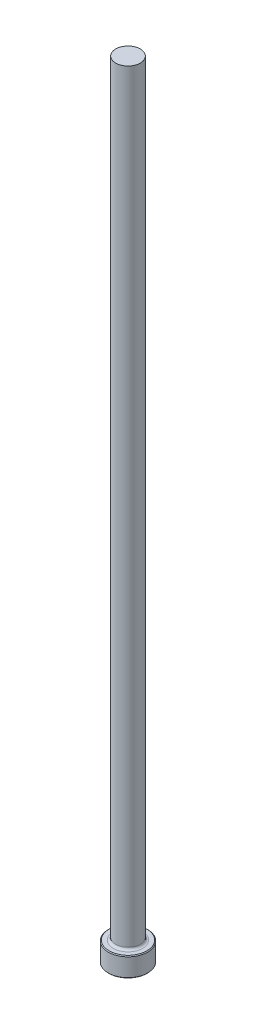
ISO-10303-21;
HEADER;
FILE_DESCRIPTION(('STEP AP214'),'2;1');
FILE_NAME('part.step','',(''),(''),'','','');
FILE_SCHEMA(('AUTOMOTIVE_DESIGN { 1 0 10303 214 1 1 1 1 }'));
ENDSEC;
DATA;
#1=APPLICATION_CONTEXT('core data for automotive mechanical design processes');
#2=APPLICATION_PROTOCOL_DEFINITION('international standard','automotive_design',2000,#1);
#3=PRODUCT_CONTEXT('',#1,'mechanical');
#4=PRODUCT('Part','Part','',(#3));
#5=PRODUCT_RELATED_PRODUCT_CATEGORY('part','',(#4));
#6=PRODUCT_DEFINITION_FORMATION('','',#4);
#7=PRODUCT_DEFINITION_CONTEXT('part definition',#1,'design');
#8=PRODUCT_DEFINITION('design','',#6,#7);
#9=PRODUCT_DEFINITION_SHAPE('','',#8);
#10=(LENGTH_UNIT() NAMED_UNIT(*) SI_UNIT(.MILLI.,.METRE.));
#11=(NAMED_UNIT(*) PLANE_ANGLE_UNIT() SI_UNIT($,.RADIAN.));
#12=(NAMED_UNIT(*) SI_UNIT($,.STERADIAN.) SOLID_ANGLE_UNIT());
#13=UNCERTAINTY_MEASURE_WITH_UNIT(LENGTH_MEASURE(1.E-05),#10,'distance_accuracy_value','');
#14=(GEOMETRIC_REPRESENTATION_CONTEXT(3) GLOBAL_UNCERTAINTY_ASSIGNED_CONTEXT((#13)) GLOBAL_UNIT_ASSIGNED_CONTEXT((#10,
#11,#12)) REPRESENTATION_CONTEXT('',''));
#15=CARTESIAN_POINT('',(0.,0.,0.));
#16=DIRECTION('',(0.,0.,1.));
#17=DIRECTION('',(1.,0.,0.));
#18=AXIS2_PLACEMENT_3D('',#15,#16,#17);
#19=CARTESIAN_POINT('',(0.,0.,0.));
#20=DIRECTION('',(0.,-1.,0.));
#21=DIRECTION('',(0.,0.,-1.));
#22=AXIS2_PLACEMENT_3D('',#19,#20,#21);
#23=PLANE('',#22);
#24=CARTESIAN_POINT('',(0.,0.,0.));
#25=DIRECTION('',(0.,-1.,0.));
#26=DIRECTION('',(0.,0.,-1.));
#27=AXIS2_PLACEMENT_3D('',#24,#25,#26);
#28=CIRCLE('',#27,6.09599999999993);
#29=CARTESIAN_POINT('',(0.,0.,-6.09599999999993));
#30=VERTEX_POINT('',#29);
#31=EDGE_CURVE('E46',#30,#30,#28,.T.);
#32=ORIENTED_EDGE('',*,*,#31,.T.);
#33=EDGE_LOOP('',(#32));
#34=FACE_BOUND('',#33,.T.);
#35=ADVANCED_FACE('F35',(#34),#23,.T.);
#36=CARTESIAN_POINT('',(0.,259.958771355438,0.));
#37=DIRECTION('',(0.,1.,0.));
#38=DIRECTION('',(0.,0.,1.));
#39=AXIS2_PLACEMENT_3D('',#36,#37,#38);
#40=CYLINDRICAL_SURFACE('',#39,6.34999999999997);
#41=CARTESIAN_POINT('',(0.,6.09600000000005,0.));
#42=DIRECTION('',(0.,1.,0.));
#43=DIRECTION('',(0.,0.,1.));
#44=AXIS2_PLACEMENT_3D('',#41,#42,#43);
#45=CIRCLE('',#44,6.34999999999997);
#46=CARTESIAN_POINT('',(0.,6.09600000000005,6.34999999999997));
#47=VERTEX_POINT('',#46);
#48=EDGE_CURVE('E50',#47,#47,#45,.F.);
#49=ORIENTED_EDGE('',*,*,#48,.T.);
#50=EDGE_LOOP('',(#49));
#51=FACE_BOUND('',#50,.T.);
#52=CARTESIAN_POINT('',(0.,0.254000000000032,0.));
#53=DIRECTION('',(0.,-1.,0.));
#54=DIRECTION('',(0.,0.,-1.));
#55=AXIS2_PLACEMENT_3D('',#52,#53,#54);
#56=CIRCLE('',#55,6.34999999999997);
#57=CARTESIAN_POINT('',(0.,0.254000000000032,-6.34999999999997));
#58=VERTEX_POINT('',#57);
#59=EDGE_CURVE('E55',#58,#58,#56,.F.);
#60=ORIENTED_EDGE('',*,*,#59,.T.);
#61=EDGE_LOOP('',(#60));
#62=FACE_BOUND('',#61,.T.);
#63=ADVANCED_FACE('F77',(#51,#62),#40,.T.);
#64=CARTESIAN_POINT('',(-6.34999999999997,6.35,0.));
#65=DIRECTION('',(0.,1.,0.));
#66=DIRECTION('',(0.,0.,1.));
#67=AXIS2_PLACEMENT_3D('',#64,#65,#66);
#68=PLANE('',#67);
#69=CARTESIAN_POINT('',(0.,6.35,0.));
#70=DIRECTION('',(0.,1.,0.));
#71=DIRECTION('',(0.,0.,1.));
#72=AXIS2_PLACEMENT_3D('',#69,#70,#71);
#73=CIRCLE('',#72,4.73074999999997);
#74=CARTESIAN_POINT('',(0.,6.35,4.73074999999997));
#75=VERTEX_POINT('',#74);
#76=EDGE_CURVE('E10',#75,#75,#73,.F.);
#77=ORIENTED_EDGE('',*,*,#76,.T.);
#78=EDGE_LOOP('',(#77));
#79=FACE_BOUND('',#78,.T.);
#80=CARTESIAN_POINT('',(0.,6.35,0.));
#81=DIRECTION('',(0.,1.,0.));
#82=DIRECTION('',(0.,0.,1.));
#83=AXIS2_PLACEMENT_3D('',#80,#81,#82);
#84=CIRCLE('',#83,6.09600000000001);
#85=CARTESIAN_POINT('',(0.,6.35,6.09600000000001));
#86=VERTEX_POINT('',#85);
#87=EDGE_CURVE('E58',#86,#86,#84,.T.);
#88=ORIENTED_EDGE('',*,*,#87,.T.);
#89=EDGE_LOOP('',(#88));
#90=FACE_BOUND('',#89,.T.);
#91=ADVANCED_FACE('F69',(#79,#90),#68,.T.);
#92=CARTESIAN_POINT('',(0.,259.958771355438,0.));
#93=DIRECTION('',(0.,1.,0.));
#94=DIRECTION('',(0.,0.,1.));
#95=AXIS2_PLACEMENT_3D('',#92,#93,#94);
#96=CYLINDRICAL_SURFACE('',#95,3.96874999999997);
#97=CARTESIAN_POINT('',(0.,7.11200000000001,0.));
#98=DIRECTION('',(0.,1.,0.));
#99=DIRECTION('',(0.,0.,1.));
#100=AXIS2_PLACEMENT_3D('',#97,#98,#99);
#101=CIRCLE('',#100,3.96874999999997);
#102=CARTESIAN_POINT('',(0.,7.11200000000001,3.96874999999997));
#103=VERTEX_POINT('',#102);
#104=EDGE_CURVE('E42',#103,#103,#101,.T.);
#105=ORIENTED_EDGE('',*,*,#104,.T.);
#106=EDGE_LOOP('',(#105));
#107=FACE_BOUND('',#106,.T.);
#108=CARTESIAN_POINT('',(0.,254.,0.));
#109=DIRECTION('',(0.,1.,0.));
#110=DIRECTION('',(0.,0.,1.));
#111=AXIS2_PLACEMENT_3D('',#108,#109,#110);
#112=CIRCLE('',#111,3.96874999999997);
#113=CARTESIAN_POINT('',(0.,254.,3.96874999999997));
#114=VERTEX_POINT('',#113);
#115=EDGE_CURVE('E61',#114,#114,#112,.T.);
#116=ORIENTED_EDGE('',*,*,#115,.F.);
#117=EDGE_LOOP('',(#116));
#118=FACE_BOUND('',#117,.T.);
#119=ADVANCED_FACE('F67',(#107,#118),#96,.T.);
#120=CARTESIAN_POINT('',(-3.96874999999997,254.,0.));
#121=DIRECTION('',(0.,1.,0.));
#122=DIRECTION('',(0.,0.,1.));
#123=AXIS2_PLACEMENT_3D('',#120,#121,#122);
#124=PLANE('',#123);
#125=ORIENTED_EDGE('',*,*,#115,.T.);
#126=EDGE_LOOP('',(#125));
#127=FACE_BOUND('',#126,.T.);
#128=ADVANCED_FACE('F65',(#127),#124,.T.);
#129=CARTESIAN_POINT('',(0.,6.35000000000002,0.));
#130=DIRECTION('',(0.,-1.,0.));
#131=DIRECTION('',(0.,0.,-1.));
#132=AXIS2_PLACEMENT_3D('',#129,#130,#131);
#133=CONICAL_SURFACE('',#132,6.09599999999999,0.78539816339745);
#134=ORIENTED_EDGE('',*,*,#48,.F.);
#135=EDGE_LOOP('',(#134));
#136=FACE_BOUND('',#135,.T.);
#137=ORIENTED_EDGE('',*,*,#87,.F.);
#138=EDGE_LOOP('',(#137));
#139=FACE_BOUND('',#138,.T.);
#140=ADVANCED_FACE('F75',(#136,#139),#133,.T.);
#141=CARTESIAN_POINT('',(0.,0.254000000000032,0.));
#142=DIRECTION('',(0.,1.,0.));
#143=DIRECTION('',(0.,0.,1.));
#144=AXIS2_PLACEMENT_3D('',#141,#142,#143);
#145=CONICAL_SURFACE('',#144,6.34999999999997,0.78539816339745);
#146=ORIENTED_EDGE('',*,*,#31,.F.);
#147=EDGE_LOOP('',(#146));
#148=FACE_BOUND('',#147,.T.);
#149=ORIENTED_EDGE('',*,*,#59,.F.);
#150=EDGE_LOOP('',(#149));
#151=FACE_BOUND('',#150,.T.);
#152=ADVANCED_FACE('F89',(#148,#151),#145,.T.);
#153=CARTESIAN_POINT('',(0.,7.11200000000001,0.));
#154=DIRECTION('',(0.,1.,0.));
#155=DIRECTION('',(0.,0.,1.));
#156=AXIS2_PLACEMENT_3D('',#153,#154,#155);
#157=TOROIDAL_SURFACE('',#156,4.73074999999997,0.762);
#158=ORIENTED_EDGE('',*,*,#76,.F.);
#159=EDGE_LOOP('',(#158));
#160=FACE_BOUND('',#159,.T.);
#161=ORIENTED_EDGE('',*,*,#104,.F.);
#162=EDGE_LOOP('',(#161));
#163=FACE_BOUND('',#162,.T.);
#164=ADVANCED_FACE('F37',(#160,#163),#157,.F.);
#165=CLOSED_SHELL('',(#35,#63,#91,#119,#128,#140,#152,#164));
#166=MANIFOLD_SOLID_BREP('B2',#165);
#167=ADVANCED_BREP_SHAPE_REPRESENTATION('',(#18,#166),#14);
#168=SHAPE_DEFINITION_REPRESENTATION(#9,#167);
ENDSEC;
END-ISO-10303-21;
